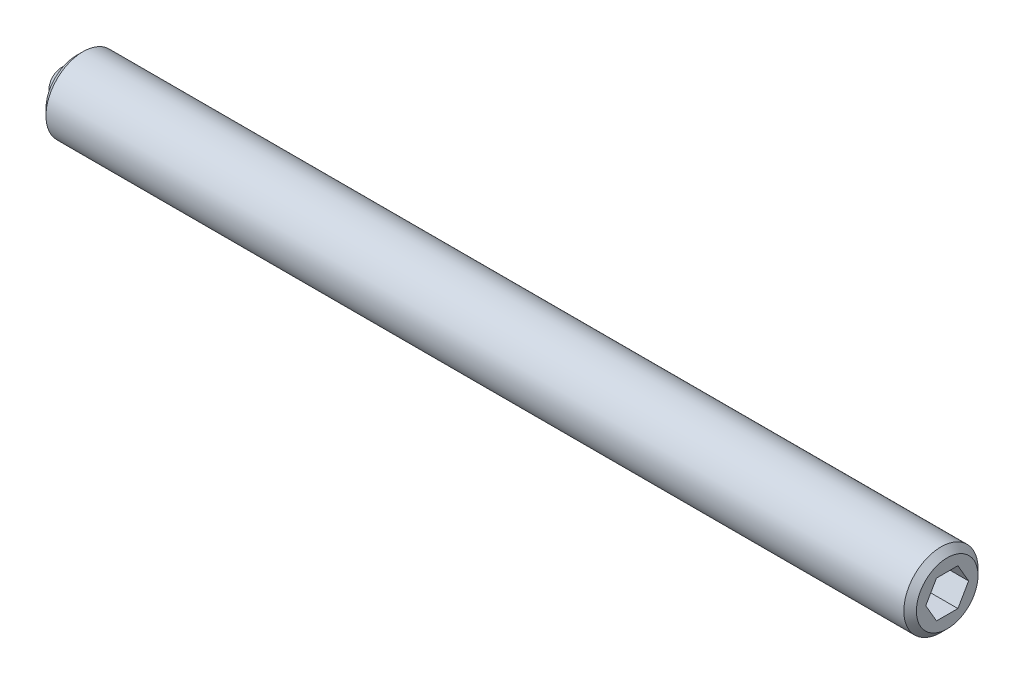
ISO-10303-21;
HEADER;
FILE_DESCRIPTION(('STEP AP214'),'2;1');
FILE_NAME('part.step','',(''),(''),'','','');
FILE_SCHEMA(('AUTOMOTIVE_DESIGN { 1 0 10303 214 1 1 1 1 }'));
ENDSEC;
DATA;
#1=APPLICATION_CONTEXT('core data for automotive mechanical design processes');
#2=APPLICATION_PROTOCOL_DEFINITION('international standard','automotive_design',2000,#1);
#3=PRODUCT_CONTEXT('',#1,'mechanical');
#4=PRODUCT('Part','Part','',(#3));
#5=PRODUCT_RELATED_PRODUCT_CATEGORY('part','',(#4));
#6=PRODUCT_DEFINITION_FORMATION('','',#4);
#7=PRODUCT_DEFINITION_CONTEXT('part definition',#1,'design');
#8=PRODUCT_DEFINITION('design','',#6,#7);
#9=PRODUCT_DEFINITION_SHAPE('','',#8);
#10=(LENGTH_UNIT() NAMED_UNIT(*) SI_UNIT(.MILLI.,.METRE.));
#11=(NAMED_UNIT(*) PLANE_ANGLE_UNIT() SI_UNIT($,.RADIAN.));
#12=(NAMED_UNIT(*) SI_UNIT($,.STERADIAN.) SOLID_ANGLE_UNIT());
#13=UNCERTAINTY_MEASURE_WITH_UNIT(LENGTH_MEASURE(1.E-05),#10,'distance_accuracy_value','');
#14=(GEOMETRIC_REPRESENTATION_CONTEXT(3) GLOBAL_UNCERTAINTY_ASSIGNED_CONTEXT((#13)) GLOBAL_UNIT_ASSIGNED_CONTEXT((#10,
#11,#12)) REPRESENTATION_CONTEXT('',''));
#15=CARTESIAN_POINT('',(0.,0.,0.));
#16=DIRECTION('',(0.,0.,1.));
#17=DIRECTION('',(1.,0.,0.));
#18=AXIS2_PLACEMENT_3D('',#15,#16,#17);
#19=CARTESIAN_POINT('',(0.,0.,0.));
#20=DIRECTION('',(0.,-1.,0.));
#21=DIRECTION('',(0.,0.,-1.));
#22=AXIS2_PLACEMENT_3D('',#19,#20,#21);
#23=SPHERICAL_SURFACE('',#22,0.8);
#24=CARTESIAN_POINT('',(0.,-0.8,0.));
#25=VERTEX_POINT('',#24);
#26=VERTEX_LOOP('',#25);
#27=FACE_BOUND('',#26,.T.);
#28=ADVANCED_FACE('F41',(#27),#23,.T.);
#29=CLOSED_SHELL('',(#28));
#30=MANIFOLD_SOLID_BREP('B2',#29);
#31=CARTESIAN_POINT('',(35.2,0.,0.));
#32=DIRECTION('',(-1.,0.,0.));
#33=DIRECTION('',(0.,0.,1.));
#34=AXIS2_PLACEMENT_3D('',#31,#32,#33);
#35=CYLINDRICAL_SURFACE('',#34,1.5);
#36=CARTESIAN_POINT('',(34.946,0.,0.));
#37=DIRECTION('',(1.,0.,0.));
#38=DIRECTION('',(0.,0.,-1.));
#39=AXIS2_PLACEMENT_3D('',#36,#37,#38);
#40=CIRCLE('',#39,1.5);
#41=CARTESIAN_POINT('',(34.946,0.,-1.5));
#42=VERTEX_POINT('',#41);
#43=EDGE_CURVE('E39',#42,#42,#40,.F.);
#44=ORIENTED_EDGE('',*,*,#43,.T.);
#45=EDGE_LOOP('',(#44));
#46=FACE_BOUND('',#45,.T.);
#47=CARTESIAN_POINT('',(0.254000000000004,0.,0.));
#48=DIRECTION('',(1.,0.,0.));
#49=DIRECTION('',(0.,0.,-1.));
#50=AXIS2_PLACEMENT_3D('',#47,#48,#49);
#51=CIRCLE('',#50,1.5);
#52=CARTESIAN_POINT('',(0.254000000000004,0.,-1.5));
#53=VERTEX_POINT('',#52);
#54=EDGE_CURVE('E157',#53,#53,#51,.T.);
#55=ORIENTED_EDGE('',*,*,#54,.T.);
#56=EDGE_LOOP('',(#55));
#57=FACE_BOUND('',#56,.T.);
#58=ADVANCED_FACE('F54',(#46,#57),#35,.T.);
#59=CARTESIAN_POINT('',(35.2,0.,0.));
#60=DIRECTION('',(1.,0.,0.));
#61=DIRECTION('',(0.,0.,-1.));
#62=AXIS2_PLACEMENT_3D('',#59,#60,#61);
#63=PLANE('',#62);
#64=DIRECTION('',(0.,0.866025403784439,-0.5));
#65=VECTOR('',#64,1.);
#66=CARTESIAN_POINT('',(35.2,-0.75,-0.43301270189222));
#67=LINE('',#66,#65);
#68=CARTESIAN_POINT('',(35.2,-0.75,-0.43301270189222));
#69=VERTEX_POINT('',#68);
#70=CARTESIAN_POINT('',(35.2,0.,-0.866025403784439));
#71=VERTEX_POINT('',#70);
#72=EDGE_CURVE('E69',#69,#71,#67,.T.);
#73=ORIENTED_EDGE('',*,*,#72,.F.);
#74=DIRECTION('',(0.,0.,-1.));
#75=VECTOR('',#74,1.);
#76=CARTESIAN_POINT('',(35.2,-0.75,0.433012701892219));
#77=LINE('',#76,#75);
#78=CARTESIAN_POINT('',(35.2,-0.75,0.433012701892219));
#79=VERTEX_POINT('',#78);
#80=EDGE_CURVE('E153',#79,#69,#77,.T.);
#81=ORIENTED_EDGE('',*,*,#80,.F.);
#82=DIRECTION('',(0.,-0.866025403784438,-0.5));
#83=VECTOR('',#82,1.);
#84=CARTESIAN_POINT('',(35.2,0.,0.866025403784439));
#85=LINE('',#84,#83);
#86=CARTESIAN_POINT('',(35.2,0.,0.866025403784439));
#87=VERTEX_POINT('',#86);
#88=EDGE_CURVE('E151',#87,#79,#85,.T.);
#89=ORIENTED_EDGE('',*,*,#88,.F.);
#90=DIRECTION('',(0.,-0.866025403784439,0.5));
#91=VECTOR('',#90,1.);
#92=CARTESIAN_POINT('',(35.2,0.75,0.433012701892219));
#93=LINE('',#92,#91);
#94=CARTESIAN_POINT('',(35.2,0.75,0.433012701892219));
#95=VERTEX_POINT('',#94);
#96=EDGE_CURVE('E117',#95,#87,#93,.T.);
#97=ORIENTED_EDGE('',*,*,#96,.F.);
#98=DIRECTION('',(0.,0.,1.));
#99=VECTOR('',#98,1.);
#100=CARTESIAN_POINT('',(35.2,0.75,-0.433012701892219));
#101=LINE('',#100,#99);
#102=CARTESIAN_POINT('',(35.2,0.75,-0.433012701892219));
#103=VERTEX_POINT('',#102);
#104=EDGE_CURVE('E147',#103,#95,#101,.T.);
#105=ORIENTED_EDGE('',*,*,#104,.F.);
#106=DIRECTION('',(0.,0.866025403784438,0.5));
#107=VECTOR('',#106,1.);
#108=CARTESIAN_POINT('',(35.2,0.,-0.866025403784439));
#109=LINE('',#108,#107);
#110=EDGE_CURVE('E143',#71,#103,#109,.T.);
#111=ORIENTED_EDGE('',*,*,#110,.F.);
#112=EDGE_LOOP('',(#73,#81,#89,#97,#105,#111));
#113=FACE_BOUND('',#112,.T.);
#114=CARTESIAN_POINT('',(35.2,0.,0.));
#115=DIRECTION('',(1.,0.,0.));
#116=DIRECTION('',(0.,0.,-1.));
#117=AXIS2_PLACEMENT_3D('',#114,#115,#116);
#118=CIRCLE('',#117,1.246);
#119=CARTESIAN_POINT('',(35.2,0.,-1.246));
#120=VERTEX_POINT('',#119);
#121=EDGE_CURVE('E62',#120,#120,#118,.T.);
#122=ORIENTED_EDGE('',*,*,#121,.T.);
#123=EDGE_LOOP('',(#122));
#124=FACE_BOUND('',#123,.T.);
#125=ADVANCED_FACE('F170',(#113,#124),#63,.T.);
#126=CARTESIAN_POINT('',(0.,0.,0.));
#127=DIRECTION('',(1.,0.,0.));
#128=DIRECTION('',(0.,0.,-1.));
#129=AXIS2_PLACEMENT_3D('',#126,#127,#128);
#130=PLANE('',#129);
#131=CARTESIAN_POINT('',(0.,0.,0.));
#132=DIRECTION('',(-1.,0.,0.));
#133=DIRECTION('',(0.,0.,1.));
#134=AXIS2_PLACEMENT_3D('',#131,#132,#133);
#135=CIRCLE('',#134,0.8);
#136=CARTESIAN_POINT('',(0.,0.,0.8));
#137=VERTEX_POINT('',#136);
#138=EDGE_CURVE('E225',#137,#137,#135,.T.);
#139=ORIENTED_EDGE('',*,*,#138,.F.);
#140=EDGE_LOOP('',(#139));
#141=FACE_BOUND('',#140,.T.);
#142=CARTESIAN_POINT('',(0.,0.,0.));
#143=DIRECTION('',(1.,0.,0.));
#144=DIRECTION('',(0.,0.,-1.));
#145=AXIS2_PLACEMENT_3D('',#142,#143,#144);
#146=CIRCLE('',#145,1.246);
#147=CARTESIAN_POINT('',(0.,0.,-1.246));
#148=VERTEX_POINT('',#147);
#149=EDGE_CURVE('E165',#148,#148,#146,.F.);
#150=ORIENTED_EDGE('',*,*,#149,.T.);
#151=EDGE_LOOP('',(#150));
#152=FACE_BOUND('',#151,.T.);
#153=ADVANCED_FACE('F182',(#141,#152),#130,.F.);
#154=CARTESIAN_POINT('',(0.254000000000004,0.,0.));
#155=DIRECTION('',(1.,0.,0.));
#156=DIRECTION('',(0.,0.,-1.));
#157=AXIS2_PLACEMENT_3D('',#154,#155,#156);
#158=CONICAL_SURFACE('',#157,1.5,0.785398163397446);
#159=ORIENTED_EDGE('',*,*,#149,.F.);
#160=EDGE_LOOP('',(#159));
#161=FACE_BOUND('',#160,.T.);
#162=ORIENTED_EDGE('',*,*,#54,.F.);
#163=EDGE_LOOP('',(#162));
#164=FACE_BOUND('',#163,.T.);
#165=ADVANCED_FACE('F174',(#161,#164),#158,.T.);
#166=CARTESIAN_POINT('',(35.2,0.,0.));
#167=DIRECTION('',(-1.,0.,0.));
#168=DIRECTION('',(0.,0.,1.));
#169=AXIS2_PLACEMENT_3D('',#166,#167,#168);
#170=CONICAL_SURFACE('',#169,1.246,0.785398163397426);
#171=ORIENTED_EDGE('',*,*,#43,.F.);
#172=EDGE_LOOP('',(#171));
#173=FACE_BOUND('',#172,.T.);
#174=ORIENTED_EDGE('',*,*,#121,.F.);
#175=EDGE_LOOP('',(#174));
#176=FACE_BOUND('',#175,.T.);
#177=ADVANCED_FACE('F56',(#173,#176),#170,.T.);
#178=CARTESIAN_POINT('',(33.2,-0.75,-0.43301270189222));
#179=DIRECTION('',(0.,-0.5,-0.866025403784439));
#180=DIRECTION('',(0.,0.866025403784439,-0.5));
#181=AXIS2_PLACEMENT_3D('',#178,#179,#180);
#182=PLANE('',#181);
#183=ORIENTED_EDGE('',*,*,#72,.T.);
#184=DIRECTION('',(1.,0.,0.));
#185=VECTOR('',#184,1.);
#186=CARTESIAN_POINT('',(33.2,0.,-0.866025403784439));
#187=LINE('',#186,#185);
#188=CARTESIAN_POINT('',(33.2,0.,-0.866025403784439));
#189=VERTEX_POINT('',#188);
#190=EDGE_CURVE('E99',#189,#71,#187,.T.);
#191=ORIENTED_EDGE('',*,*,#190,.F.);
#192=DIRECTION('',(0.,0.866025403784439,-0.5));
#193=VECTOR('',#192,1.);
#194=CARTESIAN_POINT('',(33.2,-0.75,-0.43301270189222));
#195=LINE('',#194,#193);
#196=CARTESIAN_POINT('',(33.2,-0.75,-0.43301270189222));
#197=VERTEX_POINT('',#196);
#198=EDGE_CURVE('E155',#197,#189,#195,.T.);
#199=ORIENTED_EDGE('',*,*,#198,.F.);
#200=DIRECTION('',(1.,0.,0.));
#201=VECTOR('',#200,1.);
#202=CARTESIAN_POINT('',(33.2,-0.75,-0.43301270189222));
#203=LINE('',#202,#201);
#204=EDGE_CURVE('E77',#197,#69,#203,.T.);
#205=ORIENTED_EDGE('',*,*,#204,.T.);
#206=EDGE_LOOP('',(#183,#191,#199,#205));
#207=FACE_BOUND('',#206,.T.);
#208=ADVANCED_FACE('F173',(#207),#182,.F.);
#209=CARTESIAN_POINT('',(33.2,-0.75,0.433012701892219));
#210=DIRECTION('',(0.,-1.,0.));
#211=DIRECTION('',(0.,0.,-1.));
#212=AXIS2_PLACEMENT_3D('',#209,#210,#211);
#213=PLANE('',#212);
#214=ORIENTED_EDGE('',*,*,#80,.T.);
#215=ORIENTED_EDGE('',*,*,#204,.F.);
#216=DIRECTION('',(0.,0.,-1.));
#217=VECTOR('',#216,1.);
#218=CARTESIAN_POINT('',(33.2,-0.75,0.433012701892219));
#219=LINE('',#218,#217);
#220=CARTESIAN_POINT('',(33.2,-0.75,0.433012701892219));
#221=VERTEX_POINT('',#220);
#222=EDGE_CURVE('E129',#221,#197,#219,.T.);
#223=ORIENTED_EDGE('',*,*,#222,.F.);
#224=DIRECTION('',(1.,0.,0.));
#225=VECTOR('',#224,1.);
#226=CARTESIAN_POINT('',(33.2,-0.75,0.433012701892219));
#227=LINE('',#226,#225);
#228=EDGE_CURVE('E121',#221,#79,#227,.T.);
#229=ORIENTED_EDGE('',*,*,#228,.T.);
#230=EDGE_LOOP('',(#214,#215,#223,#229));
#231=FACE_BOUND('',#230,.T.);
#232=ADVANCED_FACE('F180',(#231),#213,.F.);
#233=CARTESIAN_POINT('',(33.2,0.,0.866025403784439));
#234=DIRECTION('',(0.,-0.5,0.866025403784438));
#235=DIRECTION('',(0.,-0.866025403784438,-0.5));
#236=AXIS2_PLACEMENT_3D('',#233,#234,#235);
#237=PLANE('',#236);
#238=ORIENTED_EDGE('',*,*,#88,.T.);
#239=ORIENTED_EDGE('',*,*,#228,.F.);
#240=DIRECTION('',(0.,-0.866025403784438,-0.5));
#241=VECTOR('',#240,1.);
#242=CARTESIAN_POINT('',(33.2,0.,0.866025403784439));
#243=LINE('',#242,#241);
#244=CARTESIAN_POINT('',(33.2,0.,0.866025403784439));
#245=VERTEX_POINT('',#244);
#246=EDGE_CURVE('E125',#245,#221,#243,.T.);
#247=ORIENTED_EDGE('',*,*,#246,.F.);
#248=DIRECTION('',(1.,0.,0.));
#249=VECTOR('',#248,1.);
#250=CARTESIAN_POINT('',(33.2,0.,0.866025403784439));
#251=LINE('',#250,#249);
#252=EDGE_CURVE('E110',#245,#87,#251,.T.);
#253=ORIENTED_EDGE('',*,*,#252,.T.);
#254=EDGE_LOOP('',(#238,#239,#247,#253));
#255=FACE_BOUND('',#254,.T.);
#256=ADVANCED_FACE('F126',(#255),#237,.F.);
#257=CARTESIAN_POINT('',(33.2,0.75,0.433012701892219));
#258=DIRECTION('',(0.,0.5,0.866025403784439));
#259=DIRECTION('',(0.,-0.866025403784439,0.5));
#260=AXIS2_PLACEMENT_3D('',#257,#258,#259);
#261=PLANE('',#260);
#262=ORIENTED_EDGE('',*,*,#96,.T.);
#263=ORIENTED_EDGE('',*,*,#252,.F.);
#264=DIRECTION('',(0.,-0.866025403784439,0.5));
#265=VECTOR('',#264,1.);
#266=CARTESIAN_POINT('',(33.2,0.75,0.433012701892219));
#267=LINE('',#266,#265);
#268=CARTESIAN_POINT('',(33.2,0.75,0.433012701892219));
#269=VERTEX_POINT('',#268);
#270=EDGE_CURVE('E114',#269,#245,#267,.T.);
#271=ORIENTED_EDGE('',*,*,#270,.F.);
#272=DIRECTION('',(1.,0.,0.));
#273=VECTOR('',#272,1.);
#274=CARTESIAN_POINT('',(33.2,0.75,0.433012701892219));
#275=LINE('',#274,#273);
#276=EDGE_CURVE('E122',#269,#95,#275,.T.);
#277=ORIENTED_EDGE('',*,*,#276,.T.);
#278=EDGE_LOOP('',(#262,#263,#271,#277));
#279=FACE_BOUND('',#278,.T.);
#280=ADVANCED_FACE('F112',(#279),#261,.F.);
#281=CARTESIAN_POINT('',(33.2,0.75,-0.433012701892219));
#282=DIRECTION('',(0.,1.,0.));
#283=DIRECTION('',(0.,0.,1.));
#284=AXIS2_PLACEMENT_3D('',#281,#282,#283);
#285=PLANE('',#284);
#286=ORIENTED_EDGE('',*,*,#104,.T.);
#287=ORIENTED_EDGE('',*,*,#276,.F.);
#288=DIRECTION('',(0.,0.,1.));
#289=VECTOR('',#288,1.);
#290=CARTESIAN_POINT('',(33.2,0.75,-0.433012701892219));
#291=LINE('',#290,#289);
#292=CARTESIAN_POINT('',(33.2,0.75,-0.433012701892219));
#293=VERTEX_POINT('',#292);
#294=EDGE_CURVE('E135',#293,#269,#291,.T.);
#295=ORIENTED_EDGE('',*,*,#294,.F.);
#296=DIRECTION('',(1.,0.,0.));
#297=VECTOR('',#296,1.);
#298=CARTESIAN_POINT('',(33.2,0.75,-0.433012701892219));
#299=LINE('',#298,#297);
#300=EDGE_CURVE('E160',#293,#103,#299,.T.);
#301=ORIENTED_EDGE('',*,*,#300,.T.);
#302=EDGE_LOOP('',(#286,#287,#295,#301));
#303=FACE_BOUND('',#302,.T.);
#304=ADVANCED_FACE('F201',(#303),#285,.F.);
#305=CARTESIAN_POINT('',(33.2,0.,-0.866025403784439));
#306=DIRECTION('',(0.,0.500000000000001,-0.866025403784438));
#307=DIRECTION('',(0.,0.866025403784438,0.500000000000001));
#308=AXIS2_PLACEMENT_3D('',#305,#306,#307);
#309=PLANE('',#308);
#310=ORIENTED_EDGE('',*,*,#110,.T.);
#311=ORIENTED_EDGE('',*,*,#300,.F.);
#312=DIRECTION('',(0.,0.866025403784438,0.5));
#313=VECTOR('',#312,1.);
#314=CARTESIAN_POINT('',(33.2,0.,-0.866025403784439));
#315=LINE('',#314,#313);
#316=EDGE_CURVE('E137',#189,#293,#315,.T.);
#317=ORIENTED_EDGE('',*,*,#316,.F.);
#318=ORIENTED_EDGE('',*,*,#190,.T.);
#319=EDGE_LOOP('',(#310,#311,#317,#318));
#320=FACE_BOUND('',#319,.T.);
#321=ADVANCED_FACE('F198',(#320),#309,.F.);
#322=CARTESIAN_POINT('',(33.2,0.,0.));
#323=DIRECTION('',(1.,0.,0.));
#324=DIRECTION('',(0.,0.,-1.));
#325=AXIS2_PLACEMENT_3D('',#322,#323,#324);
#326=PLANE('',#325);
#327=ORIENTED_EDGE('',*,*,#198,.T.);
#328=ORIENTED_EDGE('',*,*,#316,.T.);
#329=ORIENTED_EDGE('',*,*,#294,.T.);
#330=ORIENTED_EDGE('',*,*,#270,.T.);
#331=ORIENTED_EDGE('',*,*,#246,.T.);
#332=ORIENTED_EDGE('',*,*,#222,.T.);
#333=EDGE_LOOP('',(#327,#328,#329,#330,#331,#332));
#334=FACE_BOUND('',#333,.T.);
#335=ADVANCED_FACE('F132',(#334),#326,.T.);
#336=CARTESIAN_POINT('',(0.8,0.,0.));
#337=DIRECTION('',(-1.,0.,0.));
#338=DIRECTION('',(0.,0.,1.));
#339=AXIS2_PLACEMENT_3D('',#336,#337,#338);
#340=CYLINDRICAL_SURFACE('',#339,0.8);
#341=CARTESIAN_POINT('',(0.8,0.,0.));
#342=DIRECTION('',(-1.,0.,0.));
#343=DIRECTION('',(0.,0.,1.));
#344=AXIS2_PLACEMENT_3D('',#341,#342,#343);
#345=CIRCLE('',#344,0.8);
#346=CARTESIAN_POINT('',(0.8,0.,0.8));
#347=VERTEX_POINT('',#346);
#348=EDGE_CURVE('E144',#347,#347,#345,.T.);
#349=ORIENTED_EDGE('',*,*,#348,.F.);
#350=EDGE_LOOP('',(#349));
#351=FACE_BOUND('',#350,.T.);
#352=ORIENTED_EDGE('',*,*,#138,.T.);
#353=EDGE_LOOP('',(#352));
#354=FACE_BOUND('',#353,.T.);
#355=ADVANCED_FACE('F214',(#351,#354),#340,.F.);
#356=CARTESIAN_POINT('',(0.8,0.,0.));
#357=DIRECTION('',(-1.,0.,0.));
#358=DIRECTION('',(0.,0.,1.));
#359=AXIS2_PLACEMENT_3D('',#356,#357,#358);
#360=PLANE('',#359);
#361=ORIENTED_EDGE('',*,*,#348,.T.);
#362=EDGE_LOOP('',(#361));
#363=FACE_BOUND('',#362,.T.);
#364=ADVANCED_FACE('F217',(#363),#360,.T.);
#365=CLOSED_SHELL('',(#58,#125,#153,#165,#177,#208,#232,#256,#280,#304,#321,#335,#355,#364));
#366=MANIFOLD_SOLID_BREP('B6',#365);
#367=ADVANCED_BREP_SHAPE_REPRESENTATION('',(#18,#30,#366),#14);
#368=SHAPE_DEFINITION_REPRESENTATION(#9,#367);
ENDSEC;
END-ISO-10303-21;
